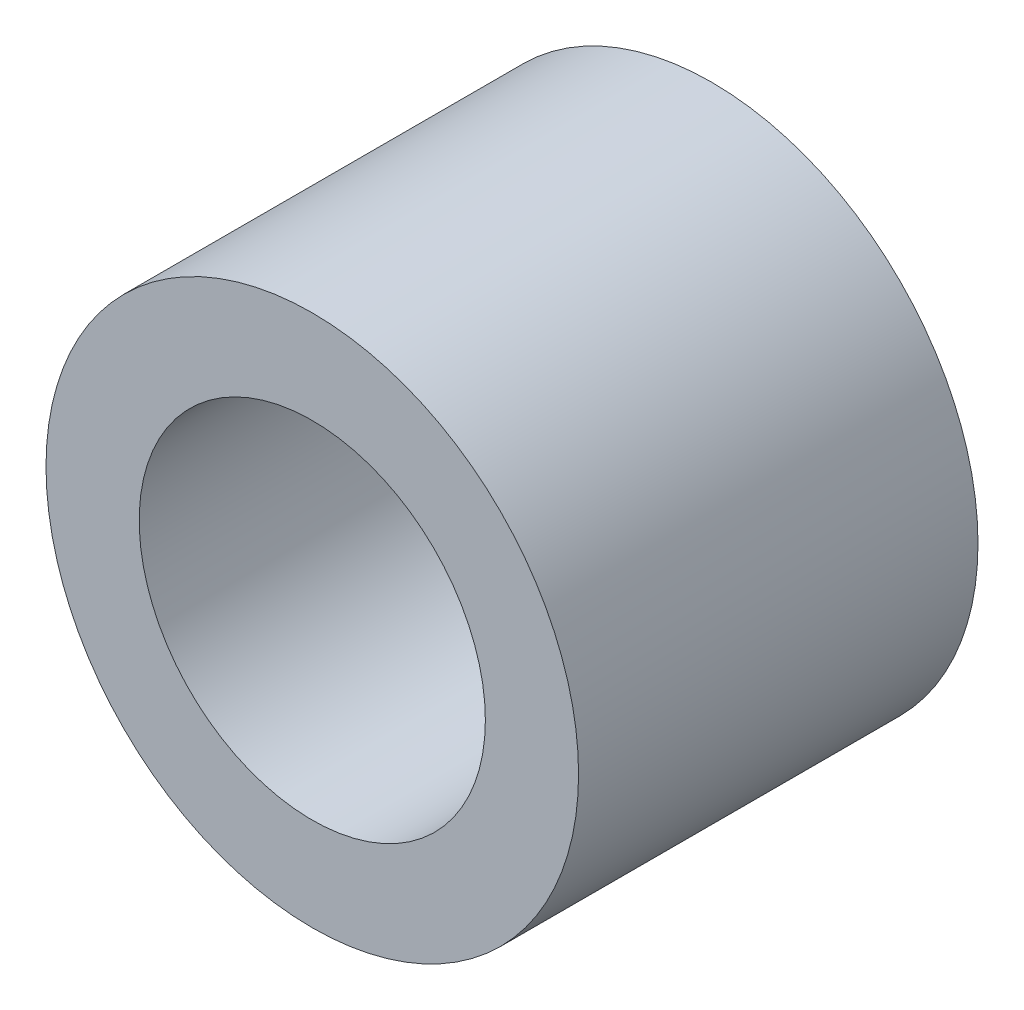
ISO-10303-21;
HEADER;
FILE_DESCRIPTION(('STEP AP214'),'2;1');
FILE_NAME('part.step','',(''),(''),'','','');
FILE_SCHEMA(('AUTOMOTIVE_DESIGN { 1 0 10303 214 1 1 1 1 }'));
ENDSEC;
DATA;
#1=APPLICATION_CONTEXT('core data for automotive mechanical design processes');
#2=APPLICATION_PROTOCOL_DEFINITION('international standard','automotive_design',2000,#1);
#3=PRODUCT_CONTEXT('',#1,'mechanical');
#4=PRODUCT('Part','Part','',(#3));
#5=PRODUCT_RELATED_PRODUCT_CATEGORY('part','',(#4));
#6=PRODUCT_DEFINITION_FORMATION('','',#4);
#7=PRODUCT_DEFINITION_CONTEXT('part definition',#1,'design');
#8=PRODUCT_DEFINITION('design','',#6,#7);
#9=PRODUCT_DEFINITION_SHAPE('','',#8);
#10=(LENGTH_UNIT() NAMED_UNIT(*) SI_UNIT(.MILLI.,.METRE.));
#11=(NAMED_UNIT(*) PLANE_ANGLE_UNIT() SI_UNIT($,.RADIAN.));
#12=(NAMED_UNIT(*) SI_UNIT($,.STERADIAN.) SOLID_ANGLE_UNIT());
#13=UNCERTAINTY_MEASURE_WITH_UNIT(LENGTH_MEASURE(1.E-05),#10,'distance_accuracy_value','');
#14=(GEOMETRIC_REPRESENTATION_CONTEXT(3) GLOBAL_UNCERTAINTY_ASSIGNED_CONTEXT((#13)) GLOBAL_UNIT_ASSIGNED_CONTEXT((#10,
#11,#12)) REPRESENTATION_CONTEXT('',''));
#15=CARTESIAN_POINT('',(0.,0.,0.));
#16=DIRECTION('',(0.,0.,1.));
#17=DIRECTION('',(1.,0.,0.));
#18=AXIS2_PLACEMENT_3D('',#15,#16,#17);
#19=CARTESIAN_POINT('',(0.,0.,7.5));
#20=DIRECTION('',(0.,0.,-1.));
#21=DIRECTION('',(-1.,0.,0.));
#22=AXIS2_PLACEMENT_3D('',#19,#20,#21);
#23=CYLINDRICAL_SURFACE('',#22,5.);
#24=CARTESIAN_POINT('',(0.,0.,7.5));
#25=DIRECTION('',(0.,0.,1.));
#26=DIRECTION('',(1.,0.,0.));
#27=AXIS2_PLACEMENT_3D('',#24,#25,#26);
#28=CIRCLE('',#27,5.);
#29=CARTESIAN_POINT('',(5.,0.,7.5));
#30=VERTEX_POINT('',#29);
#31=EDGE_CURVE('E10',#30,#30,#28,.T.);
#32=ORIENTED_EDGE('',*,*,#31,.F.);
#33=EDGE_LOOP('',(#32));
#34=FACE_BOUND('',#33,.T.);
#35=CARTESIAN_POINT('',(0.,0.,0.));
#36=DIRECTION('',(0.,0.,1.));
#37=DIRECTION('',(1.,0.,0.));
#38=AXIS2_PLACEMENT_3D('',#35,#36,#37);
#39=CIRCLE('',#38,5.);
#40=CARTESIAN_POINT('',(5.,0.,0.));
#41=VERTEX_POINT('',#40);
#42=EDGE_CURVE('E40',#41,#41,#39,.T.);
#43=ORIENTED_EDGE('',*,*,#42,.T.);
#44=EDGE_LOOP('',(#43));
#45=FACE_BOUND('',#44,.T.);
#46=ADVANCED_FACE('F37',(#34,#45),#23,.T.);
#47=CARTESIAN_POINT('',(0.,0.,7.5));
#48=DIRECTION('',(0.,0.,1.));
#49=DIRECTION('',(1.,0.,0.));
#50=AXIS2_PLACEMENT_3D('',#47,#48,#49);
#51=PLANE('',#50);
#52=CARTESIAN_POINT('',(0.,0.,7.5));
#53=DIRECTION('',(0.,0.,1.));
#54=DIRECTION('',(1.,0.,0.));
#55=AXIS2_PLACEMENT_3D('',#52,#53,#54);
#56=CIRCLE('',#55,3.25);
#57=CARTESIAN_POINT('',(3.25,0.,7.5));
#58=VERTEX_POINT('',#57);
#59=EDGE_CURVE('E51',#58,#58,#56,.T.);
#60=ORIENTED_EDGE('',*,*,#59,.F.);
#61=EDGE_LOOP('',(#60));
#62=FACE_BOUND('',#61,.T.);
#63=ORIENTED_EDGE('',*,*,#31,.T.);
#64=EDGE_LOOP('',(#63));
#65=FACE_BOUND('',#64,.T.);
#66=ADVANCED_FACE('F68',(#62,#65),#51,.T.);
#67=CARTESIAN_POINT('',(0.,0.,0.));
#68=DIRECTION('',(0.,0.,1.));
#69=DIRECTION('',(1.,0.,0.));
#70=AXIS2_PLACEMENT_3D('',#67,#68,#69);
#71=PLANE('',#70);
#72=CARTESIAN_POINT('',(0.,0.,0.));
#73=DIRECTION('',(0.,0.,1.));
#74=DIRECTION('',(1.,0.,0.));
#75=AXIS2_PLACEMENT_3D('',#72,#73,#74);
#76=CIRCLE('',#75,3.25);
#77=CARTESIAN_POINT('',(3.25,0.,0.));
#78=VERTEX_POINT('',#77);
#79=EDGE_CURVE('E49',#78,#78,#76,.T.);
#80=ORIENTED_EDGE('',*,*,#79,.T.);
#81=EDGE_LOOP('',(#80));
#82=FACE_BOUND('',#81,.T.);
#83=ORIENTED_EDGE('',*,*,#42,.F.);
#84=EDGE_LOOP('',(#83));
#85=FACE_BOUND('',#84,.T.);
#86=ADVANCED_FACE('F59',(#82,#85),#71,.F.);
#87=CARTESIAN_POINT('',(0.,0.,0.));
#88=DIRECTION('',(0.,0.,1.));
#89=DIRECTION('',(1.,0.,0.));
#90=AXIS2_PLACEMENT_3D('',#87,#88,#89);
#91=CYLINDRICAL_SURFACE('',#90,3.25);
#92=ORIENTED_EDGE('',*,*,#79,.F.);
#93=EDGE_LOOP('',(#92));
#94=FACE_BOUND('',#93,.T.);
#95=ORIENTED_EDGE('',*,*,#59,.T.);
#96=EDGE_LOOP('',(#95));
#97=FACE_BOUND('',#96,.T.);
#98=ADVANCED_FACE('F62',(#94,#97),#91,.F.);
#99=CLOSED_SHELL('',(#46,#66,#86,#98));
#100=MANIFOLD_SOLID_BREP('B2',#99);
#101=ADVANCED_BREP_SHAPE_REPRESENTATION('',(#18,#100),#14);
#102=SHAPE_DEFINITION_REPRESENTATION(#9,#101);
ENDSEC;
END-ISO-10303-21;
